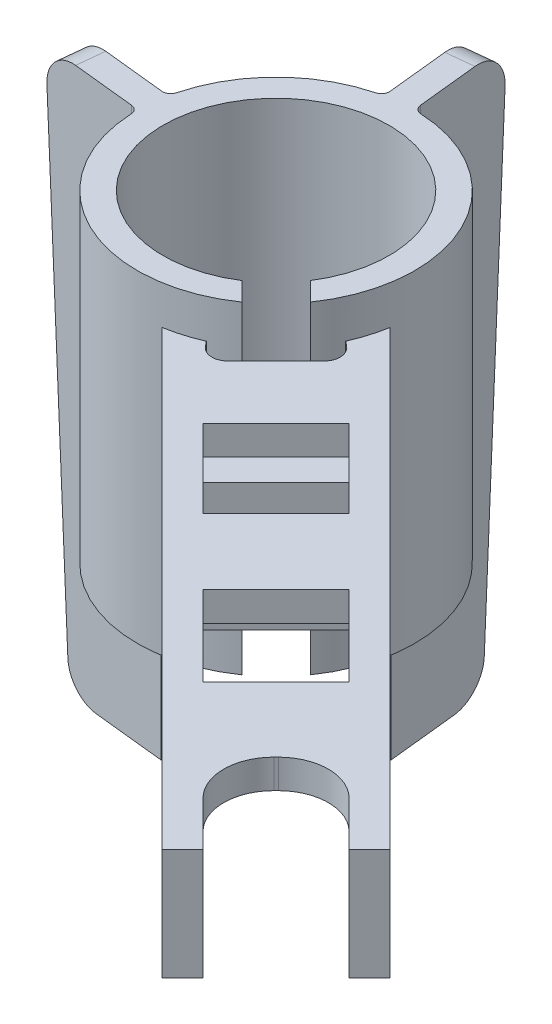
from build123d import *
from build123d.topology import SkipClean

# Parameters (mm, degrees)
BOSS_EXTRUDE1_DEPTH             = 10
BOSS_EXTRUDE2_DEPTH             = 1
BOSS_EXTRUDE3_DEPTH             = 7
CUT_EXTRUDE1_REACH              = 22.186
CUT_EXTRUDE2_REACH              = 22.166
BOSS_EXTRUDE4_REACH             = 24.566
BOSS_EXTRUDE4_END_RADIUS        = 3.5
SKETCH6_W                       = 5
SKETCH6_H                       = 3.45
SKETCH6_W_2                     = 3.2
SKETCH6_H_2                     = 1.65
BOSS_EXTRUDE4_DIRECTION_2_DEPTH = 19
CUT_EXTRUDE3_REACH              = 32.254
CUT_EXTRUDE4_REACH              = 32.254
CUT_EXTRUDE5_REACH              = 30.604


with BuildPart() as part:
    # Sketch1 → Boss-Extrude1 (new body)
    with BuildSketch(Plane(origin=(0, 0, 0), x_dir=(1, 0, 0), z_dir=(0, 1, 0))):
        with BuildLine():
            Line((-7.414489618, 1.20663528), (-4.430578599, 0.893013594))
            ThreePointArc((-4.430578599, 0.893013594), (-4.262003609, 0.936193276), (-4.162443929, 1.078916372))
            ThreePointArc((-4.162443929, 1.078916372), (-3.040559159, 3.040559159), (-1.078916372, 4.162443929))
            ThreePointArc((-1.078916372, 4.162443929), (-0.936193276, 4.262003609), (-0.893013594, 4.430578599))
            Line((-0.893013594, 4.430578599), (-1.20663528, 7.414489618))
            Line((-1.20663528, 7.414489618), (-0.361291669, 7.503338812))
            Line((-0.361291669, 7.503338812), (-0.047669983, 4.519427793))
            ThreePointArc((-0.047669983, 4.519427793), (0.02961483, 4.363514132), (0.189918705, 4.29580387))
            ThreePointArc((0.189918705, 4.29580387), (3.856330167, 1.902292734), (3.524282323, -2.463622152))
            Line((3.524282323, -2.463622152), (2.947715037, -1.887054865))
            ThreePointArc((2.947715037, -1.887054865), (-2.474873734, 2.474873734), (1.887054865, -2.947715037))
            Line((1.887054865, -2.947715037), (2.463622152, -3.524282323))
            ThreePointArc((2.463622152, -3.524282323), (-1.902292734, -3.856330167), (-4.29580387, -0.189918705))
            ThreePointArc((-4.29580387, -0.189918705), (-4.363514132, -0.02961483), (-4.519427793, 0.047669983))
            Line((-4.519427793, 0.047669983), (-7.503338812, 0.361291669))
            Line((-7.503338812, 0.361291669), (-7.414489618, 1.20663528))
        make_face()
    extrude(amount=-BOSS_EXTRUDE1_DEPTH)

    # Sketch2 → Boss-Extrude2 (add)
    with BuildSketch(Plane(origin=(0, -8.25, 0), x_dir=(-1, 0, 0), z_dir=(0, -1, 0))):
        with BuildLine():
            Line((-1.887054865, -2.947715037), (-1.15601211, -2.216672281))
            ThreePointArc((-1.15601211, -2.216672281), (1.767766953, 1.767766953), (-2.216672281, -1.15601211))
            Line((-2.216672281, -1.15601211), (-2.947715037, -1.887054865))
            ThreePointArc((-2.947715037, -1.887054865), (2.474873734, 2.474873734), (-1.887054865, -2.947715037))
        make_face()
    extrude(amount=BOSS_EXTRUDE2_DEPTH)

    # Sketch3 → Boss-Extrude3 (add)
    with SkipClean():  # the faces are left unmerged after this step: merging them gives an invalid solid
        with BuildSketch(Plane.XZ.offset(10)):
            with BuildLine():
                Line((-7.503338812, -0.361291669), (-3.499493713, 0.059529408))
                ThreePointArc((-3.499493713, 0.059529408), (-3.480826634, -0.365849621), (-3.41064452, -0.785814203))
                Line((-3.41064452, -0.785814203), (-7.414489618, -1.20663528))
                Line((-7.414489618, -1.20663528), (-7.503338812, -0.361291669))
            make_face()
            with BuildLine():
                Line((-1.20663528, -7.414489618), (-0.785814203, -3.41064452))
                ThreePointArc((-0.785814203, -3.41064452), (-0.365849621, -3.480826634), (0.059529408, -3.499493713))
                Line((0.059529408, -3.499493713), (-0.361291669, -7.503338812))
                Line((-0.361291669, -7.503338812), (-1.20663528, -7.414489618))
            make_face()
        extrude(amount=BOSS_EXTRUDE3_DEPTH)

    # Sketch4 → Cut-Extrude1 (cut, up to next)
    with BuildSketch(Plane(origin=(-0.044424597, 0, 0.422671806), x_dir=(0.9945218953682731, 0, 0.10452846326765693), z_dir=(-0.10452846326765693, 0, 0.9945218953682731)), mode=Mode.PRIVATE) as cut_extrude1_sk1:
        with BuildLine():
            Line((-4.499652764, 0), (-6.450238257, 0))
            ThreePointArc((-6.450238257, 0), (-7.174298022, -0.310262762), (-7.449060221, -1.048525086))
            Line((-7.449060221, -1.048525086), (-6.720325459, -16.048525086))
            ThreePointArc((-6.720325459, -16.048525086), (-6.411240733, -16.724059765), (-5.721503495, -17))
            Line((-5.721503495, -17), (-3.474100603, -17))
            Line((-3.474100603, -17), (-3.474100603, -18.237576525))
            Line((-3.474100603, -18.237576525), (-8.636241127, -18.237576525))
            Line((-8.636241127, -18.237576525), (-8.636241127, 0.642542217))
            Line((-8.636241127, 0.642542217), (-4.499652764, 0.642542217))
            Line((-4.499652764, 0.642542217), (-4.499652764, 0))
        make_face()
    cut_extrude1_tool1 = extrude(cut_extrude1_sk1.sketch, amount=-CUT_EXTRUDE1_REACH, mode=Mode.PRIVATE) & part.part
    add(cut_extrude1_tool1.solids().sort_by_distance((-7.422183, -10.016233, -0.352762))[0], mode=Mode.SUBTRACT)

    # Sketch5 → Cut-Extrude2 (cut, up to next)
    with BuildSketch(Plane(origin=(0.422671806, 0, -0.044424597), x_dir=(-0.10452846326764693, 0, -0.9945218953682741), z_dir=(0.9945218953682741, 0, -0.10452846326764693)), mode=Mode.PRIVATE) as cut_extrude2_sk1:
        with BuildLine():
            Line((4.499652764, 0), (6.39817036, 0))
            ThreePointArc((6.39817036, 0), (7.158143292, -0.325651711), (7.446533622, -1.100531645))
            Line((7.446533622, -1.100531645), (6.7226182, -16.001332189))
            ThreePointArc((6.7226182, -16.001332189), (6.398202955, -16.710373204), (5.674254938, -17))
            Line((5.674254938, -17), (3.474100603, -17))
            Line((3.474100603, -17), (3.474100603, -17.961134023))
            Line((3.474100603, -17.961134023), (9.689471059, -17.961134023))
            Line((9.689471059, -17.961134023), (9.520710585, 0.644708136))
            Line((9.520710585, 0.644708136), (4.499652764, 0.644708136))
            Line((4.499652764, 0.644708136), (4.499652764, 0))
        make_face()
    cut_extrude2_tool1 = extrude(cut_extrude2_sk1.sketch, amount=-CUT_EXTRUDE2_REACH, mode=Mode.PRIVATE) & part.part
    add(cut_extrude2_tool1.solids().sort_by_distance((-0.417746, -9.418745, -8.040463))[0], mode=Mode.SUBTRACT)

    # Boss-Extrude4: up to this cylinder (the profile starts outside it)
    with SkipClean():  # the faces are left unmerged after this step: merging them gives an invalid solid
        boss_extrude4_end = Plane(origin=(0, -1.260747, 0), z_dir=(0, 1, 0)) * Cylinder(BOSS_EXTRUDE4_END_RADIUS, 57.132, mode=Mode.PRIVATE)
        # Sketch6 → Boss-Extrude4 (add, up to the surface)
        with BuildSketch(Plane(origin=(3.040559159, 0, 3.040559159), x_dir=(0.7071067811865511, 0, -0.707106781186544), z_dir=(0.707106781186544, 0, 0.7071067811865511)), mode=Mode.PRIVATE) as boss_extrude4_sk1:
            with Locations((0, -2.925)):
                Rectangle(SKETCH6_W, SKETCH6_H)
            with Locations((0, -2.925)):
                Rectangle(SKETCH6_W_2, SKETCH6_H_2, mode=Mode.SUBTRACT)
        boss_extrude4_tool1 = extrude(boss_extrude4_sk1.sketch, amount=-BOSS_EXTRUDE4_REACH, mode=Mode.PRIVATE) - boss_extrude4_end
        add(boss_extrude4_tool1.solids().sort_by_distance((3.040559, -1.260747, 3.040559))[0])

    # Sketch6 → Boss-Extrude4 direction 2 (add)
    with SkipClean():  # the faces are left unmerged after this step: merging them gives an invalid solid
        with BuildSketch(Plane(origin=(3.040559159, 0, 3.040559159), x_dir=(0.7071067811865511, 0, -0.707106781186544), z_dir=(0.707106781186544, 0, 0.7071067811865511))):
            with Locations((0, -2.925)):
                Rectangle(SKETCH6_W, SKETCH6_H)
            with Locations((0, -2.925)):
                Rectangle(SKETCH6_W_2, SKETCH6_H_2, mode=Mode.SUBTRACT)
        extrude(amount=BOSS_EXTRUDE4_DIRECTION_2_DEPTH)

    # Sketch7 → Cut-Extrude3 (cut, up to next)
    with BuildSketch(Plane(origin=(0, -1.2, 0), x_dir=(1, 0, 0), z_dir=(0, 1, 0)), mode=Mode.PRIVATE) as cut_extrude3_sk1:
        with BuildLine():
            Line((15.344217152, -17.606958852), (13.965358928, -16.228100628))
            ThreePointArc((13.965358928, -16.228100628), (13.511374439, -15.132085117), (13.965358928, -14.036069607))
            Line((13.965358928, -14.036069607), (14.036069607, -13.965358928))
            ThreePointArc((14.036069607, -13.965358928), (15.132085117, -13.511374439), (16.228100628, -13.965358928))
            Line((16.228100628, -13.965358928), (17.606958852, -15.344217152))
            Line((17.606958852, -15.344217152), (15.344217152, -17.606958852))
        make_face()
    cut_extrude3_tool1 = extrude(cut_extrude3_sk1.sketch, amount=-CUT_EXTRUDE3_REACH, mode=Mode.PRIVATE) & part.part
    # Sketch7 → Cut-Extrude3 (cut, up to next)
    with BuildSketch(Plane(origin=(0, -1.2, 0), x_dir=(1, 0, 0), z_dir=(0, 1, 0)), mode=Mode.PRIVATE) as cut_extrude3_sk2:
        Polygon((8.379215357, -10.641957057), (10.641957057, -8.379215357), (13.116830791, -10.854089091), (10.854089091, -13.116830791), align=None)
    cut_extrude3_tool2 = extrude(cut_extrude3_sk2.sketch, amount=-CUT_EXTRUDE3_REACH, mode=Mode.PRIVATE) & part.part
    # Sketch7 → Cut-Extrude3 (cut, up to next)
    with BuildSketch(Plane(origin=(0, -1.2, 0), x_dir=(1, 0, 0), z_dir=(0, 1, 0)), mode=Mode.PRIVATE) as cut_extrude3_sk3:
        Polygon((3.924442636, -6.187184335), (6.187184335, -3.924442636), (8.591347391, -6.328605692), (6.328605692, -8.591347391), align=None)
    cut_extrude3_tool3 = extrude(cut_extrude3_sk3.sketch, amount=-CUT_EXTRUDE3_REACH, mode=Mode.PRIVATE) & part.part
    add(cut_extrude3_tool1.solids().sort_by_distance((15.338807, -1.2, 15.338807))[0], mode=Mode.SUBTRACT)
    add(cut_extrude3_tool2.solids().sort_by_distance((10.748023, -1.2, 10.748023))[0], mode=Mode.SUBTRACT)
    add(cut_extrude3_tool3.solids().sort_by_distance((6.257895, -1.2, 6.257895))[0], mode=Mode.SUBTRACT)

    # Cut-Extrude4: up to this face of the body (flat: up to its plane)
    cut_extrude4_end = Plane(part.part.faces().sort_by_distance((9.75807358, -4.65, 9.75807358))[0])
    # Sketch8 → Cut-Extrude4 (cut, up to the picked face)
    with BuildSketch(Plane(origin=(0, -1.2, 0), x_dir=(1, 0, 0), z_dir=(0, 1, 0)), mode=Mode.PRIVATE) as cut_extrude4_sk1:
        with BuildLine():
            Line((1.887054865, -2.947715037), (2.463622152, -3.524282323))
            ThreePointArc((2.463622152, -3.524282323), (2.122539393, -3.739629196), (1.762778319, -3.922067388))
            Line((1.762778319, -3.922067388), (1.894971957, -4.082617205))
            ThreePointArc((1.894971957, -4.082617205), (2.256834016, -4.264215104), (2.634518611, -4.118351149))
            Line((2.634518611, -4.118351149), (4.118351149, -2.634518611))
            ThreePointArc((4.118351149, -2.634518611), (4.264215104, -2.256834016), (4.082617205, -1.894971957))
            Line((4.082617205, -1.894971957), (3.922067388, -1.762778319))
            ThreePointArc((3.922067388, -1.762778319), (3.739629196, -2.122539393), (3.524282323, -2.463622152))
            Line((3.524282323, -2.463622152), (2.947715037, -1.887054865))
            ThreePointArc((2.947715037, -1.887054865), (2.474873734, -2.474873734), (1.887054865, -2.947715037))
        make_face()
    cut_extrude4_tool1 = split(extrude(cut_extrude4_sk1.sketch, amount=-CUT_EXTRUDE4_REACH, mode=Mode.PRIVATE), bisect_by=cut_extrude4_end, keep=Keep.BOTH, mode=Mode.PRIVATE)
    add(cut_extrude4_tool1.solids().sort_by(Axis((2.984609, -1.2, 2.984609), (0, -1, 0)))[0], mode=Mode.SUBTRACT)

    # Sketch9 → Cut-Extrude5 (cut, up to next)
    with BuildSketch(Plane.XZ.offset(4.65), mode=Mode.PRIVATE) as cut_extrude5_sk1:
        Polygon((9.75807358, 12.02081528), (12.02081528, 9.75807358), (17.606958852, 15.344217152), (15.344217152, 17.606958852), align=None)
    cut_extrude5_tool1 = extrude(cut_extrude5_sk1.sketch, amount=-CUT_EXTRUDE5_REACH, mode=Mode.PRIVATE) & part.part
    # Sketch9 → Cut-Extrude5 (cut, up to next)
    with BuildSketch(Plane.XZ.offset(4.65), mode=Mode.PRIVATE) as cut_extrude5_sk2:
        Polygon((8.485281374, 10.748023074), (10.748023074, 8.485281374), (8.27314934, 6.01040764), (6.01040764, 8.27314934), align=None)
    cut_extrude5_tool2 = extrude(cut_extrude5_sk2.sketch, amount=-CUT_EXTRUDE5_REACH, mode=Mode.PRIVATE) & part.part
    # Sketch9 → Cut-Extrude5 (cut, up to next)
    with BuildSketch(Plane.XZ.offset(4.65), mode=Mode.PRIVATE) as cut_extrude5_sk3:
        Polygon((2.952170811, 5.214912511), (5.214912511, 2.952170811), (7.000357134, 4.737615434), (4.737615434, 7.000357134), align=None)
    cut_extrude5_tool3 = extrude(cut_extrude5_sk3.sketch, amount=-CUT_EXTRUDE5_REACH, mode=Mode.PRIVATE) & part.part
    add(cut_extrude5_tool1.solids().sort_by_distance((13.682516, -4.65, 13.682516))[0], mode=Mode.SUBTRACT)
    add(cut_extrude5_tool2.solids().sort_by_distance((8.379215, -4.65, 8.379215))[0], mode=Mode.SUBTRACT)
    add(cut_extrude5_tool3.solids().sort_by_distance((4.976264, -4.65, 4.976264))[0], mode=Mode.SUBTRACT)


solid = part.part
